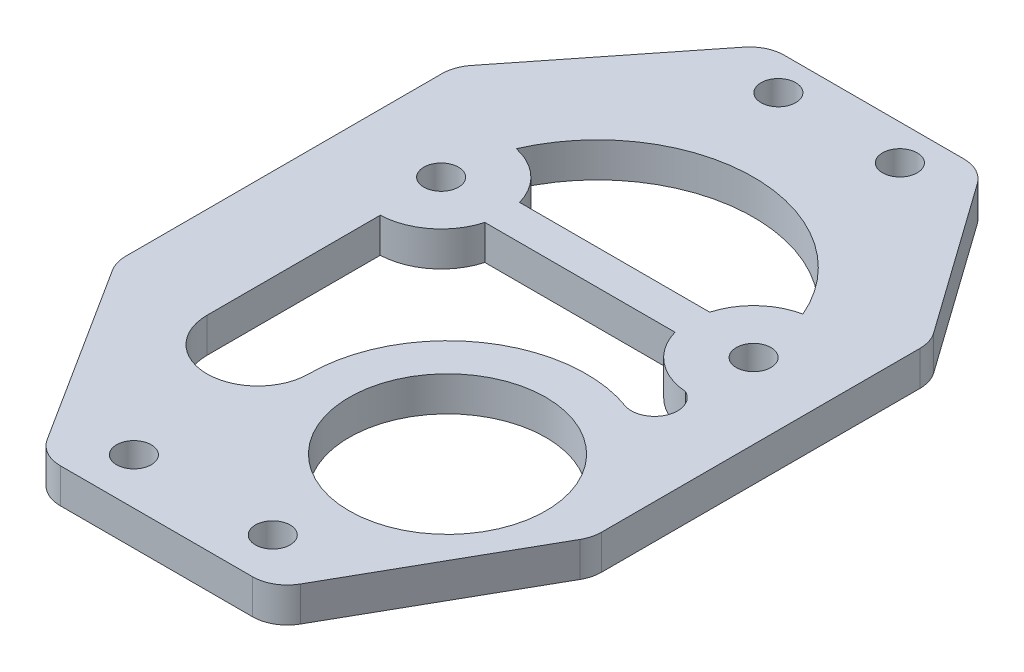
ISO-10303-21;
HEADER;
FILE_DESCRIPTION(('STEP AP214'),'2;1');
FILE_NAME('part.step','',(''),(''),'','','');
FILE_SCHEMA(('AUTOMOTIVE_DESIGN { 1 0 10303 214 1 1 1 1 }'));
ENDSEC;
DATA;
#1=APPLICATION_CONTEXT('core data for automotive mechanical design processes');
#2=APPLICATION_PROTOCOL_DEFINITION('international standard','automotive_design',2000,#1);
#3=PRODUCT_CONTEXT('',#1,'mechanical');
#4=PRODUCT('Part','Part','',(#3));
#5=PRODUCT_RELATED_PRODUCT_CATEGORY('part','',(#4));
#6=PRODUCT_DEFINITION_FORMATION('','',#4);
#7=PRODUCT_DEFINITION_CONTEXT('part definition',#1,'design');
#8=PRODUCT_DEFINITION('design','',#6,#7);
#9=PRODUCT_DEFINITION_SHAPE('','',#8);
#10=(LENGTH_UNIT() NAMED_UNIT(*) SI_UNIT(.MILLI.,.METRE.));
#11=(NAMED_UNIT(*) PLANE_ANGLE_UNIT() SI_UNIT($,.RADIAN.));
#12=(NAMED_UNIT(*) SI_UNIT($,.STERADIAN.) SOLID_ANGLE_UNIT());
#13=UNCERTAINTY_MEASURE_WITH_UNIT(LENGTH_MEASURE(1.E-05),#10,'distance_accuracy_value','');
#14=(GEOMETRIC_REPRESENTATION_CONTEXT(3) GLOBAL_UNCERTAINTY_ASSIGNED_CONTEXT((#13)) GLOBAL_UNIT_ASSIGNED_CONTEXT((#10,
#11,#12)) REPRESENTATION_CONTEXT('',''));
#15=CARTESIAN_POINT('',(0.,0.,0.));
#16=DIRECTION('',(0.,0.,1.));
#17=DIRECTION('',(1.,0.,0.));
#18=AXIS2_PLACEMENT_3D('',#15,#16,#17);
#19=CARTESIAN_POINT('',(-7.79820170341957,3.,-28.));
#20=DIRECTION('',(0.,-1.,0.));
#21=DIRECTION('',(0.,0.,-1.));
#22=AXIS2_PLACEMENT_3D('',#19,#20,#21);
#23=PLANE('',#22);
#24=CARTESIAN_POINT('',(13.5,3.,-7.05));
#25=DIRECTION('',(0.,1.,0.));
#26=DIRECTION('',(0.,0.,1.));
#27=AXIS2_PLACEMENT_3D('',#24,#25,#26);
#28=CIRCLE('',#27,1.5);
#29=CARTESIAN_POINT('',(13.5,3.,-5.55));
#30=VERTEX_POINT('',#29);
#31=EDGE_CURVE('E253',#30,#30,#28,.T.);
#32=ORIENTED_EDGE('',*,*,#31,.F.);
#33=EDGE_LOOP('',(#32));
#34=FACE_BOUND('',#33,.T.);
#35=CARTESIAN_POINT('',(-5.25,3.,-27.9407829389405));
#36=DIRECTION('',(0.,1.,0.));
#37=DIRECTION('',(0.,0.,1.));
#38=AXIS2_PLACEMENT_3D('',#35,#36,#37);
#39=CIRCLE('',#38,1.5);
#40=CARTESIAN_POINT('',(-5.25,3.,-26.4407829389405));
#41=VERTEX_POINT('',#40);
#42=EDGE_CURVE('E259',#41,#41,#39,.T.);
#43=ORIENTED_EDGE('',*,*,#42,.F.);
#44=EDGE_LOOP('',(#43));
#45=FACE_BOUND('',#44,.T.);
#46=CARTESIAN_POINT('',(5.25,3.,-27.9407829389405));
#47=DIRECTION('',(0.,1.,0.));
#48=DIRECTION('',(0.,0.,1.));
#49=AXIS2_PLACEMENT_3D('',#46,#47,#48);
#50=CIRCLE('',#49,1.5);
#51=CARTESIAN_POINT('',(5.25,3.,-26.4407829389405));
#52=VERTEX_POINT('',#51);
#53=EDGE_CURVE('E265',#52,#52,#50,.T.);
#54=ORIENTED_EDGE('',*,*,#53,.F.);
#55=EDGE_LOOP('',(#54));
#56=FACE_BOUND('',#55,.T.);
#57=CARTESIAN_POINT('',(7.5,3.,13.4));
#58=DIRECTION('',(0.,-1.,0.));
#59=DIRECTION('',(0.,0.,1.));
#60=AXIS2_PLACEMENT_3D('',#57,#58,#59);
#61=CIRCLE('',#60,12.);
#62=CARTESIAN_POINT('',(-4.49999999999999,3.,13.4));
#63=VERTEX_POINT('',#62);
#64=CARTESIAN_POINT('',(11.655254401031,3.,2.14238653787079));
#65=VERTEX_POINT('',#64);
#66=EDGE_CURVE('E271',#63,#65,#61,.T.);
#67=ORIENTED_EDGE('',*,*,#66,.F.);
#68=CARTESIAN_POINT('',(-8.89070194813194,3.,13.4));
#69=DIRECTION('',(0.,1.,0.));
#70=DIRECTION('',(0.,0.,1.));
#71=AXIS2_PLACEMENT_3D('',#68,#69,#70);
#72=CIRCLE('',#71,4.39070194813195);
#73=CARTESIAN_POINT('',(-13.2814038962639,3.,13.4));
#74=VERTEX_POINT('',#73);
#75=EDGE_CURVE('E285',#74,#63,#72,.T.);
#76=ORIENTED_EDGE('',*,*,#75,.F.);
#77=DIRECTION('',(0.,0.,1.));
#78=VECTOR('',#77,1.);
#79=CARTESIAN_POINT('',(-13.2814038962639,3.,0.));
#80=LINE('',#79,#78);
#81=CARTESIAN_POINT('',(-13.2814038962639,3.,-1.5679809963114));
#82=VERTEX_POINT('',#81);
#83=EDGE_CURVE('E282',#82,#74,#80,.T.);
#84=ORIENTED_EDGE('',*,*,#83,.F.);
#85=CARTESIAN_POINT('',(-13.5,3.,-7.05));
#86=DIRECTION('',(0.,-1.,0.));
#87=DIRECTION('',(0.,0.,1.));
#88=AXIS2_PLACEMENT_3D('',#85,#86,#87);
#89=CIRCLE('',#88,5.48637554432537);
#90=CARTESIAN_POINT('',(-8.22266008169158,3.,-5.55));
#91=VERTEX_POINT('',#90);
#92=EDGE_CURVE('E280',#91,#82,#89,.T.);
#93=ORIENTED_EDGE('',*,*,#92,.F.);
#94=DIRECTION('',(-1.,0.,0.));
#95=VECTOR('',#94,1.);
#96=CARTESIAN_POINT('',(-8.22266008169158,3.,-5.55));
#97=LINE('',#96,#95);
#98=CARTESIAN_POINT('',(8.20849737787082,3.,-5.55));
#99=VERTEX_POINT('',#98);
#100=EDGE_CURVE('E278',#99,#91,#97,.T.);
#101=ORIENTED_EDGE('',*,*,#100,.F.);
#102=CARTESIAN_POINT('',(13.5,3.,-7.05));
#103=DIRECTION('',(0.,-1.,0.));
#104=DIRECTION('',(0.,0.,1.));
#105=AXIS2_PLACEMENT_3D('',#102,#103,#104);
#106=CIRCLE('',#105,5.5);
#107=CARTESIAN_POINT('',(13.113110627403,3.,-1.56362445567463));
#108=VERTEX_POINT('',#107);
#109=EDGE_CURVE('E276',#108,#99,#106,.T.);
#110=ORIENTED_EDGE('',*,*,#109,.F.);
#111=CARTESIAN_POINT('',(12.21,3.,0.220861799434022));
#112=DIRECTION('',(0.,1.,0.));
#113=DIRECTION('',(0.,0.,1.));
#114=AXIS2_PLACEMENT_3D('',#111,#112,#113);
#115=CIRCLE('',#114,2.);
#116=EDGE_CURVE('E273',#65,#108,#115,.T.);
#117=ORIENTED_EDGE('',*,*,#116,.F.);
#118=EDGE_LOOP('',(#67,#76,#84,#93,#101,#110,#117));
#119=FACE_BOUND('',#118,.T.);
#120=CARTESIAN_POINT('',(-7.79820170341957,3.,-28.));
#121=DIRECTION('',(0.,1.,0.));
#122=DIRECTION('',(0.,0.,-1.));
#123=AXIS2_PLACEMENT_3D('',#120,#121,#122);
#124=CIRCLE('',#123,3.);
#125=CARTESIAN_POINT('',(-7.79820170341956,3.,-31.));
#126=VERTEX_POINT('',#125);
#127=CARTESIAN_POINT('',(-10.1508333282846,3.,-29.8614844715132));
#128=VERTEX_POINT('',#127);
#129=EDGE_CURVE('E348',#126,#128,#124,.T.);
#130=ORIENTED_EDGE('',*,*,#129,.T.);
#131=DIRECTION('',(-0.620494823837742,0.,0.784210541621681));
#132=VECTOR('',#131,1.);
#133=CARTESIAN_POINT('',(-20.5640355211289,3.,-16.7007897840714));
#134=LINE('',#133,#132);
#135=CARTESIAN_POINT('',(-20.5640355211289,3.,-16.7007897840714));
#136=VERTEX_POINT('',#135);
#137=EDGE_CURVE('E351',#128,#136,#134,.T.);
#138=ORIENTED_EDGE('',*,*,#137,.T.);
#139=CARTESIAN_POINT('',(-18.2114038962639,3.,-14.8393053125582));
#140=DIRECTION('',(0.,1.,0.));
#141=DIRECTION('',(0.,0.,-1.));
#142=AXIS2_PLACEMENT_3D('',#139,#140,#141);
#143=CIRCLE('',#142,3.);
#144=CARTESIAN_POINT('',(-21.2114038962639,3.,-14.8393053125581));
#145=VERTEX_POINT('',#144);
#146=EDGE_CURVE('E354',#136,#145,#143,.T.);
#147=ORIENTED_EDGE('',*,*,#146,.T.);
#148=DIRECTION('',(0.,0.,1.));
#149=VECTOR('',#148,1.);
#150=CARTESIAN_POINT('',(-21.2114038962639,3.,-14.8393053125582));
#151=LINE('',#150,#149);
#152=CARTESIAN_POINT('',(-21.2114038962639,3.,12.4977287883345));
#153=VERTEX_POINT('',#152);
#154=EDGE_CURVE('E356',#145,#153,#151,.T.);
#155=ORIENTED_EDGE('',*,*,#154,.T.);
#156=CARTESIAN_POINT('',(-18.2114038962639,3.,12.4977287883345));
#157=DIRECTION('',(0.,1.,0.));
#158=DIRECTION('',(0.,0.,1.));
#159=AXIS2_PLACEMENT_3D('',#156,#157,#158);
#160=CIRCLE('',#159,3.);
#161=CARTESIAN_POINT('',(-20.7428525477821,3.,14.1076255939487));
#162=VERTEX_POINT('',#161);
#163=EDGE_CURVE('E358',#153,#162,#160,.T.);
#164=ORIENTED_EDGE('',*,*,#163,.T.);
#165=DIRECTION('',(0.536632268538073,0.,0.843816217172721));
#166=VECTOR('',#165,1.);
#167=CARTESIAN_POINT('',(-20.7428525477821,3.,14.1076255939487));
#168=LINE('',#167,#166);
#169=CARTESIAN_POINT('',(-10.8840482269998,3.,29.6098968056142));
#170=VERTEX_POINT('',#169);
#171=EDGE_CURVE('E360',#162,#170,#168,.T.);
#172=ORIENTED_EDGE('',*,*,#171,.T.);
#173=CARTESIAN_POINT('',(-8.35259957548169,3.,28.));
#174=DIRECTION('',(0.,1.,0.));
#175=DIRECTION('',(0.,0.,1.));
#176=AXIS2_PLACEMENT_3D('',#173,#174,#175);
#177=CIRCLE('',#176,2.99999999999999);
#178=CARTESIAN_POINT('',(-8.35259957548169,3.,31.));
#179=VERTEX_POINT('',#178);
#180=EDGE_CURVE('E362',#170,#179,#177,.T.);
#181=ORIENTED_EDGE('',*,*,#180,.T.);
#182=DIRECTION('',(1.,0.,0.));
#183=VECTOR('',#182,1.);
#184=CARTESIAN_POINT('',(-8.35259957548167,3.,31.));
#185=LINE('',#184,#183);
#186=CARTESIAN_POINT('',(8.25268787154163,3.,31.));
#187=VERTEX_POINT('',#186);
#188=EDGE_CURVE('E364',#179,#187,#185,.T.);
#189=ORIENTED_EDGE('',*,*,#188,.T.);
#190=CARTESIAN_POINT('',(8.25268787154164,3.,28.));
#191=DIRECTION('',(0.,1.,0.));
#192=DIRECTION('',(0.,0.,-1.));
#193=AXIS2_PLACEMENT_3D('',#190,#191,#192);
#194=CIRCLE('',#193,3.);
#195=CARTESIAN_POINT('',(10.8621094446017,3.,29.4801753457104));
#196=VERTEX_POINT('',#195);
#197=EDGE_CURVE('E366',#187,#196,#194,.T.);
#198=ORIENTED_EDGE('',*,*,#197,.T.);
#199=DIRECTION('',(0.493391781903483,0.,-0.869807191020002));
#200=VECTOR('',#199,1.);
#201=CARTESIAN_POINT('',(19.60942157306,3.,14.0594179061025));
#202=LINE('',#201,#200);
#203=CARTESIAN_POINT('',(19.60942157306,3.,14.0594179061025));
#204=VERTEX_POINT('',#203);
#205=EDGE_CURVE('E368',#196,#204,#202,.T.);
#206=ORIENTED_EDGE('',*,*,#205,.T.);
#207=CARTESIAN_POINT('',(17.,3.,12.5792425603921));
#208=DIRECTION('',(0.,1.,0.));
#209=DIRECTION('',(0.,0.,1.));
#210=AXIS2_PLACEMENT_3D('',#207,#208,#209);
#211=CIRCLE('',#210,3.);
#212=CARTESIAN_POINT('',(20.,3.,12.579242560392));
#213=VERTEX_POINT('',#212);
#214=EDGE_CURVE('E370',#204,#213,#211,.T.);
#215=ORIENTED_EDGE('',*,*,#214,.T.);
#216=DIRECTION('',(0.,0.,-1.));
#217=VECTOR('',#216,1.);
#218=CARTESIAN_POINT('',(20.,3.,-14.924711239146));
#219=LINE('',#218,#217);
#220=CARTESIAN_POINT('',(20.,3.,-14.924711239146));
#221=VERTEX_POINT('',#220);
#222=EDGE_CURVE('E372',#213,#221,#219,.T.);
#223=ORIENTED_EDGE('',*,*,#222,.T.);
#224=CARTESIAN_POINT('',(17.,3.,-14.9247112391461));
#225=DIRECTION('',(0.,1.,0.));
#226=DIRECTION('',(0.,0.,-1.));
#227=AXIS2_PLACEMENT_3D('',#224,#225,#226);
#228=CIRCLE('',#227,3.);
#229=CARTESIAN_POINT('',(19.4448766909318,3.,-16.6632675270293));
#230=VERTEX_POINT('',#229);
#231=EDGE_CURVE('E374',#221,#230,#228,.T.);
#232=ORIENTED_EDGE('',*,*,#231,.T.);
#233=DIRECTION('',(-0.579518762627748,0.,-0.814958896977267));
#234=VECTOR('',#233,1.);
#235=CARTESIAN_POINT('',(10.1470149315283,3.,-29.7385562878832));
#236=LINE('',#235,#234);
#237=CARTESIAN_POINT('',(10.1470149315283,3.,-29.7385562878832));
#238=VERTEX_POINT('',#237);
#239=EDGE_CURVE('E376',#230,#238,#236,.T.);
#240=ORIENTED_EDGE('',*,*,#239,.T.);
#241=CARTESIAN_POINT('',(7.70213824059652,3.,-28.));
#242=DIRECTION('',(0.,1.,0.));
#243=DIRECTION('',(0.,0.,1.));
#244=AXIS2_PLACEMENT_3D('',#241,#242,#243);
#245=CIRCLE('',#244,3.);
#246=CARTESIAN_POINT('',(7.70213824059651,3.,-31.));
#247=VERTEX_POINT('',#246);
#248=EDGE_CURVE('E378',#238,#247,#245,.T.);
#249=ORIENTED_EDGE('',*,*,#248,.T.);
#250=DIRECTION('',(-1.,0.,0.));
#251=VECTOR('',#250,1.);
#252=CARTESIAN_POINT('',(-7.79820170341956,3.,-31.));
#253=LINE('',#252,#251);
#254=EDGE_CURVE('E380',#247,#126,#253,.T.);
#255=ORIENTED_EDGE('',*,*,#254,.T.);
#256=EDGE_LOOP('',(#130,#138,#147,#155,#164,#172,#181,#189,#198,#206,#215,#223,#232,#240,#249,#255));
#257=FACE_BOUND('',#256,.T.);
#258=CARTESIAN_POINT('',(-13.5,3.,-7.05));
#259=DIRECTION('',(0.,1.,0.));
#260=DIRECTION('',(0.,0.,1.));
#261=AXIS2_PLACEMENT_3D('',#258,#259,#260);
#262=CIRCLE('',#261,1.5);
#263=CARTESIAN_POINT('',(-13.5,3.,-5.55));
#264=VERTEX_POINT('',#263);
#265=EDGE_CURVE('E342',#264,#264,#262,.T.);
#266=ORIENTED_EDGE('',*,*,#265,.F.);
#267=EDGE_LOOP('',(#266));
#268=FACE_BOUND('',#267,.T.);
#269=CARTESIAN_POINT('',(7.5,3.,13.4));
#270=DIRECTION('',(0.,1.,0.));
#271=DIRECTION('',(0.,0.,1.));
#272=AXIS2_PLACEMENT_3D('',#269,#270,#271);
#273=CIRCLE('',#272,8.5);
#274=CARTESIAN_POINT('',(7.5,3.,21.9));
#275=VERTEX_POINT('',#274);
#276=EDGE_CURVE('E336',#275,#275,#273,.T.);
#277=ORIENTED_EDGE('',*,*,#276,.F.);
#278=EDGE_LOOP('',(#277));
#279=FACE_BOUND('',#278,.T.);
#280=CARTESIAN_POINT('',(6.00000000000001,3.,27.));
#281=DIRECTION('',(0.,1.,0.));
#282=DIRECTION('',(0.,0.,1.));
#283=AXIS2_PLACEMENT_3D('',#280,#281,#282);
#284=CIRCLE('',#283,1.5);
#285=CARTESIAN_POINT('',(6.00000000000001,3.,28.5));
#286=VERTEX_POINT('',#285);
#287=EDGE_CURVE('E330',#286,#286,#284,.T.);
#288=ORIENTED_EDGE('',*,*,#287,.F.);
#289=EDGE_LOOP('',(#288));
#290=FACE_BOUND('',#289,.T.);
#291=CARTESIAN_POINT('',(-5.99999999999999,3.,27.));
#292=DIRECTION('',(0.,1.,0.));
#293=DIRECTION('',(0.,0.,1.));
#294=AXIS2_PLACEMENT_3D('',#291,#292,#293);
#295=CIRCLE('',#294,1.5);
#296=CARTESIAN_POINT('',(-5.99999999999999,3.,28.5));
#297=VERTEX_POINT('',#296);
#298=EDGE_CURVE('E324',#297,#297,#295,.T.);
#299=ORIENTED_EDGE('',*,*,#298,.F.);
#300=EDGE_LOOP('',(#299));
#301=FACE_BOUND('',#300,.T.);
#302=CARTESIAN_POINT('',(0.,3.,-7.05));
#303=DIRECTION('',(0.,1.,0.));
#304=DIRECTION('',(0.,0.,1.));
#305=AXIS2_PLACEMENT_3D('',#302,#303,#304);
#306=CIRCLE('',#305,13.5);
#307=CARTESIAN_POINT('',(12.3796296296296,3.,-12.4346792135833));
#308=VERTEX_POINT('',#307);
#309=CARTESIAN_POINT('',(-12.385173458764,3.,-12.4219157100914));
#310=VERTEX_POINT('',#309);
#311=EDGE_CURVE('E217',#308,#310,#306,.T.);
#312=ORIENTED_EDGE('',*,*,#311,.F.);
#313=CARTESIAN_POINT('',(13.5,3.,-7.05));
#314=DIRECTION('',(0.,-1.,0.));
#315=DIRECTION('',(0.,0.,1.));
#316=AXIS2_PLACEMENT_3D('',#313,#314,#315);
#317=CIRCLE('',#316,5.5);
#318=CARTESIAN_POINT('',(8.20849737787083,3.,-8.55));
#319=VERTEX_POINT('',#318);
#320=EDGE_CURVE('E239',#319,#308,#317,.T.);
#321=ORIENTED_EDGE('',*,*,#320,.F.);
#322=DIRECTION('',(1.,0.,0.));
#323=VECTOR('',#322,1.);
#324=CARTESIAN_POINT('',(-8.22266008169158,3.,-8.55));
#325=LINE('',#324,#323);
#326=CARTESIAN_POINT('',(-8.22266008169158,3.,-8.55));
#327=VERTEX_POINT('',#326);
#328=EDGE_CURVE('E237',#327,#319,#325,.T.);
#329=ORIENTED_EDGE('',*,*,#328,.F.);
#330=CARTESIAN_POINT('',(-13.5,3.,-7.05));
#331=DIRECTION('',(0.,-1.,0.));
#332=DIRECTION('',(0.,0.,1.));
#333=AXIS2_PLACEMENT_3D('',#330,#331,#332);
#334=CIRCLE('',#333,5.48637554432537);
#335=EDGE_CURVE('E225',#310,#327,#334,.T.);
#336=ORIENTED_EDGE('',*,*,#335,.F.);
#337=EDGE_LOOP('',(#312,#321,#329,#336));
#338=FACE_BOUND('',#337,.T.);
#339=ADVANCED_FACE('F38',(#34,#45,#56,#119,#257,#268,#279,#290,#301,#338),#23,.F.);
#340=CARTESIAN_POINT('',(-7.79820170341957,0.,-28.));
#341=DIRECTION('',(0.,-1.,0.));
#342=DIRECTION('',(0.,0.,-1.));
#343=AXIS2_PLACEMENT_3D('',#340,#341,#342);
#344=PLANE('',#343);
#345=CARTESIAN_POINT('',(-5.25,0.,-27.9407829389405));
#346=DIRECTION('',(0.,1.,0.));
#347=DIRECTION('',(0.,0.,1.));
#348=AXIS2_PLACEMENT_3D('',#345,#346,#347);
#349=CIRCLE('',#348,1.5);
#350=CARTESIAN_POINT('',(-5.25,0.,-26.4407829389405));
#351=VERTEX_POINT('',#350);
#352=EDGE_CURVE('E256',#351,#351,#349,.T.);
#353=ORIENTED_EDGE('',*,*,#352,.T.);
#354=EDGE_LOOP('',(#353));
#355=FACE_BOUND('',#354,.T.);
#356=CARTESIAN_POINT('',(-8.89070194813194,0.,13.4));
#357=DIRECTION('',(0.,1.,0.));
#358=DIRECTION('',(0.,0.,1.));
#359=AXIS2_PLACEMENT_3D('',#356,#357,#358);
#360=CIRCLE('',#359,4.39070194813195);
#361=CARTESIAN_POINT('',(-13.2814038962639,0.,13.4));
#362=VERTEX_POINT('',#361);
#363=CARTESIAN_POINT('',(-4.49999999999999,0.,13.4));
#364=VERTEX_POINT('',#363);
#365=EDGE_CURVE('E274',#362,#364,#360,.T.);
#366=ORIENTED_EDGE('',*,*,#365,.T.);
#367=CARTESIAN_POINT('',(7.5,0.,13.4));
#368=DIRECTION('',(0.,-1.,0.));
#369=DIRECTION('',(0.,0.,1.));
#370=AXIS2_PLACEMENT_3D('',#367,#368,#369);
#371=CIRCLE('',#370,12.);
#372=CARTESIAN_POINT('',(11.655254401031,0.,2.14238653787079));
#373=VERTEX_POINT('',#372);
#374=EDGE_CURVE('E268',#364,#373,#371,.T.);
#375=ORIENTED_EDGE('',*,*,#374,.T.);
#376=CARTESIAN_POINT('',(12.21,0.,0.220861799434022));
#377=DIRECTION('',(0.,1.,0.));
#378=DIRECTION('',(0.,0.,1.));
#379=AXIS2_PLACEMENT_3D('',#376,#377,#378);
#380=CIRCLE('',#379,2.);
#381=CARTESIAN_POINT('',(13.113110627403,0.,-1.56362445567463));
#382=VERTEX_POINT('',#381);
#383=EDGE_CURVE('E290',#373,#382,#380,.T.);
#384=ORIENTED_EDGE('',*,*,#383,.T.);
#385=CARTESIAN_POINT('',(13.5,0.,-7.05));
#386=DIRECTION('',(0.,-1.,0.));
#387=DIRECTION('',(0.,0.,1.));
#388=AXIS2_PLACEMENT_3D('',#385,#386,#387);
#389=CIRCLE('',#388,5.5);
#390=CARTESIAN_POINT('',(8.20849737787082,0.,-5.55));
#391=VERTEX_POINT('',#390);
#392=EDGE_CURVE('E293',#382,#391,#389,.T.);
#393=ORIENTED_EDGE('',*,*,#392,.T.);
#394=DIRECTION('',(-1.,0.,0.));
#395=VECTOR('',#394,1.);
#396=CARTESIAN_POINT('',(-8.22266008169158,0.,-5.55));
#397=LINE('',#396,#395);
#398=CARTESIAN_POINT('',(-8.22266008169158,0.,-5.55));
#399=VERTEX_POINT('',#398);
#400=EDGE_CURVE('E296',#391,#399,#397,.T.);
#401=ORIENTED_EDGE('',*,*,#400,.T.);
#402=CARTESIAN_POINT('',(-13.5,0.,-7.05));
#403=DIRECTION('',(0.,-1.,0.));
#404=DIRECTION('',(0.,0.,1.));
#405=AXIS2_PLACEMENT_3D('',#402,#403,#404);
#406=CIRCLE('',#405,5.48637554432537);
#407=CARTESIAN_POINT('',(-13.2814038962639,0.,-1.5679809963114));
#408=VERTEX_POINT('',#407);
#409=EDGE_CURVE('E299',#399,#408,#406,.T.);
#410=ORIENTED_EDGE('',*,*,#409,.T.);
#411=DIRECTION('',(0.,0.,1.));
#412=VECTOR('',#411,1.);
#413=CARTESIAN_POINT('',(-13.2814038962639,0.,13.4));
#414=LINE('',#413,#412);
#415=EDGE_CURVE('E302',#408,#362,#414,.T.);
#416=ORIENTED_EDGE('',*,*,#415,.T.);
#417=EDGE_LOOP('',(#366,#375,#384,#393,#401,#410,#416));
#418=FACE_BOUND('',#417,.T.);
#419=CARTESIAN_POINT('',(-5.99999999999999,0.,27.));
#420=DIRECTION('',(0.,1.,0.));
#421=DIRECTION('',(0.,0.,1.));
#422=AXIS2_PLACEMENT_3D('',#419,#420,#421);
#423=CIRCLE('',#422,1.5);
#424=CARTESIAN_POINT('',(-5.99999999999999,0.,28.5));
#425=VERTEX_POINT('',#424);
#426=EDGE_CURVE('E323',#425,#425,#423,.T.);
#427=ORIENTED_EDGE('',*,*,#426,.T.);
#428=EDGE_LOOP('',(#427));
#429=FACE_BOUND('',#428,.T.);
#430=CARTESIAN_POINT('',(7.5,0.,13.4));
#431=DIRECTION('',(0.,1.,0.));
#432=DIRECTION('',(0.,0.,1.));
#433=AXIS2_PLACEMENT_3D('',#430,#431,#432);
#434=CIRCLE('',#433,8.5);
#435=CARTESIAN_POINT('',(7.5,0.,21.9));
#436=VERTEX_POINT('',#435);
#437=EDGE_CURVE('E333',#436,#436,#434,.T.);
#438=ORIENTED_EDGE('',*,*,#437,.T.);
#439=EDGE_LOOP('',(#438));
#440=FACE_BOUND('',#439,.T.);
#441=CARTESIAN_POINT('',(-7.79820170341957,0.,-28.));
#442=DIRECTION('',(0.,1.,0.));
#443=DIRECTION('',(0.,0.,-1.));
#444=AXIS2_PLACEMENT_3D('',#441,#442,#443);
#445=CIRCLE('',#444,3.);
#446=CARTESIAN_POINT('',(-7.79820170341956,0.,-31.));
#447=VERTEX_POINT('',#446);
#448=CARTESIAN_POINT('',(-10.1508333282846,0.,-29.8614844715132));
#449=VERTEX_POINT('',#448);
#450=EDGE_CURVE('E345',#447,#449,#445,.T.);
#451=ORIENTED_EDGE('',*,*,#450,.F.);
#452=DIRECTION('',(-1.,0.,0.));
#453=VECTOR('',#452,1.);
#454=CARTESIAN_POINT('',(-7.79820170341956,0.,-31.));
#455=LINE('',#454,#453);
#456=CARTESIAN_POINT('',(7.70213824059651,0.,-31.));
#457=VERTEX_POINT('',#456);
#458=EDGE_CURVE('E352',#457,#447,#455,.T.);
#459=ORIENTED_EDGE('',*,*,#458,.F.);
#460=CARTESIAN_POINT('',(7.70213824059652,0.,-28.));
#461=DIRECTION('',(0.,1.,0.));
#462=DIRECTION('',(0.,0.,1.));
#463=AXIS2_PLACEMENT_3D('',#460,#461,#462);
#464=CIRCLE('',#463,3.);
#465=CARTESIAN_POINT('',(10.1470149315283,0.,-29.7385562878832));
#466=VERTEX_POINT('',#465);
#467=EDGE_CURVE('E411',#466,#457,#464,.T.);
#468=ORIENTED_EDGE('',*,*,#467,.F.);
#469=DIRECTION('',(-0.579518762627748,0.,-0.814958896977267));
#470=VECTOR('',#469,1.);
#471=CARTESIAN_POINT('',(10.1470149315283,0.,-29.7385562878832));
#472=LINE('',#471,#470);
#473=CARTESIAN_POINT('',(19.4448766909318,0.,-16.6632675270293));
#474=VERTEX_POINT('',#473);
#475=EDGE_CURVE('E409',#474,#466,#472,.T.);
#476=ORIENTED_EDGE('',*,*,#475,.F.);
#477=CARTESIAN_POINT('',(17.,0.,-14.9247112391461));
#478=DIRECTION('',(0.,1.,0.));
#479=DIRECTION('',(0.,0.,-1.));
#480=AXIS2_PLACEMENT_3D('',#477,#478,#479);
#481=CIRCLE('',#480,3.);
#482=CARTESIAN_POINT('',(20.,0.,-14.924711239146));
#483=VERTEX_POINT('',#482);
#484=EDGE_CURVE('E407',#483,#474,#481,.T.);
#485=ORIENTED_EDGE('',*,*,#484,.F.);
#486=DIRECTION('',(0.,0.,-1.));
#487=VECTOR('',#486,1.);
#488=CARTESIAN_POINT('',(20.,0.,-14.924711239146));
#489=LINE('',#488,#487);
#490=CARTESIAN_POINT('',(20.,0.,12.579242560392));
#491=VERTEX_POINT('',#490);
#492=EDGE_CURVE('E405',#491,#483,#489,.T.);
#493=ORIENTED_EDGE('',*,*,#492,.F.);
#494=CARTESIAN_POINT('',(17.,0.,12.5792425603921));
#495=DIRECTION('',(0.,1.,0.));
#496=DIRECTION('',(0.,0.,1.));
#497=AXIS2_PLACEMENT_3D('',#494,#495,#496);
#498=CIRCLE('',#497,3.);
#499=CARTESIAN_POINT('',(19.60942157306,0.,14.0594179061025));
#500=VERTEX_POINT('',#499);
#501=EDGE_CURVE('E403',#500,#491,#498,.T.);
#502=ORIENTED_EDGE('',*,*,#501,.F.);
#503=DIRECTION('',(0.493391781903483,0.,-0.869807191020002));
#504=VECTOR('',#503,1.);
#505=CARTESIAN_POINT('',(19.60942157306,0.,14.0594179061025));
#506=LINE('',#505,#504);
#507=CARTESIAN_POINT('',(10.8621094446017,0.,29.4801753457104));
#508=VERTEX_POINT('',#507);
#509=EDGE_CURVE('E401',#508,#500,#506,.T.);
#510=ORIENTED_EDGE('',*,*,#509,.F.);
#511=CARTESIAN_POINT('',(8.25268787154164,0.,28.));
#512=DIRECTION('',(0.,1.,0.));
#513=DIRECTION('',(0.,0.,-1.));
#514=AXIS2_PLACEMENT_3D('',#511,#512,#513);
#515=CIRCLE('',#514,3.);
#516=CARTESIAN_POINT('',(8.25268787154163,0.,31.));
#517=VERTEX_POINT('',#516);
#518=EDGE_CURVE('E399',#517,#508,#515,.T.);
#519=ORIENTED_EDGE('',*,*,#518,.F.);
#520=DIRECTION('',(1.,0.,0.));
#521=VECTOR('',#520,1.);
#522=CARTESIAN_POINT('',(-8.35259957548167,0.,31.));
#523=LINE('',#522,#521);
#524=CARTESIAN_POINT('',(-8.35259957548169,0.,31.));
#525=VERTEX_POINT('',#524);
#526=EDGE_CURVE('E397',#525,#517,#523,.T.);
#527=ORIENTED_EDGE('',*,*,#526,.F.);
#528=CARTESIAN_POINT('',(-8.35259957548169,0.,28.));
#529=DIRECTION('',(0.,1.,0.));
#530=DIRECTION('',(0.,0.,1.));
#531=AXIS2_PLACEMENT_3D('',#528,#529,#530);
#532=CIRCLE('',#531,2.99999999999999);
#533=CARTESIAN_POINT('',(-10.8840482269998,0.,29.6098968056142));
#534=VERTEX_POINT('',#533);
#535=EDGE_CURVE('E395',#534,#525,#532,.T.);
#536=ORIENTED_EDGE('',*,*,#535,.F.);
#537=DIRECTION('',(0.536632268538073,0.,0.843816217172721));
#538=VECTOR('',#537,1.);
#539=CARTESIAN_POINT('',(-20.7428525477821,0.,14.1076255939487));
#540=LINE('',#539,#538);
#541=CARTESIAN_POINT('',(-20.7428525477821,0.,14.1076255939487));
#542=VERTEX_POINT('',#541);
#543=EDGE_CURVE('E393',#542,#534,#540,.T.);
#544=ORIENTED_EDGE('',*,*,#543,.F.);
#545=CARTESIAN_POINT('',(-18.2114038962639,0.,12.4977287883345));
#546=DIRECTION('',(0.,1.,0.));
#547=DIRECTION('',(0.,0.,1.));
#548=AXIS2_PLACEMENT_3D('',#545,#546,#547);
#549=CIRCLE('',#548,3.);
#550=CARTESIAN_POINT('',(-21.2114038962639,0.,12.4977287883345));
#551=VERTEX_POINT('',#550);
#552=EDGE_CURVE('E391',#551,#542,#549,.T.);
#553=ORIENTED_EDGE('',*,*,#552,.F.);
#554=DIRECTION('',(0.,0.,1.));
#555=VECTOR('',#554,1.);
#556=CARTESIAN_POINT('',(-21.2114038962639,0.,-14.8393053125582));
#557=LINE('',#556,#555);
#558=CARTESIAN_POINT('',(-21.2114038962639,0.,-14.8393053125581));
#559=VERTEX_POINT('',#558);
#560=EDGE_CURVE('E389',#559,#551,#557,.T.);
#561=ORIENTED_EDGE('',*,*,#560,.F.);
#562=CARTESIAN_POINT('',(-18.2114038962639,0.,-14.8393053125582));
#563=DIRECTION('',(0.,1.,0.));
#564=DIRECTION('',(0.,0.,-1.));
#565=AXIS2_PLACEMENT_3D('',#562,#563,#564);
#566=CIRCLE('',#565,3.);
#567=CARTESIAN_POINT('',(-20.5640355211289,0.,-16.7007897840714));
#568=VERTEX_POINT('',#567);
#569=EDGE_CURVE('E387',#568,#559,#566,.T.);
#570=ORIENTED_EDGE('',*,*,#569,.F.);
#571=DIRECTION('',(-0.620494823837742,0.,0.784210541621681));
#572=VECTOR('',#571,1.);
#573=CARTESIAN_POINT('',(-20.5640355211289,0.,-16.7007897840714));
#574=LINE('',#573,#572);
#575=EDGE_CURVE('E385',#449,#568,#574,.T.);
#576=ORIENTED_EDGE('',*,*,#575,.F.);
#577=EDGE_LOOP('',(#451,#459,#468,#476,#485,#493,#502,#510,#519,#527,#536,#544,#553,#561,#570,#576));
#578=FACE_BOUND('',#577,.T.);
#579=CARTESIAN_POINT('',(-13.5,0.,-7.05));
#580=DIRECTION('',(0.,1.,0.));
#581=DIRECTION('',(0.,0.,1.));
#582=AXIS2_PLACEMENT_3D('',#579,#580,#581);
#583=CIRCLE('',#582,1.5);
#584=CARTESIAN_POINT('',(-13.5,0.,-5.55));
#585=VERTEX_POINT('',#584);
#586=EDGE_CURVE('E339',#585,#585,#583,.T.);
#587=ORIENTED_EDGE('',*,*,#586,.T.);
#588=EDGE_LOOP('',(#587));
#589=FACE_BOUND('',#588,.T.);
#590=CARTESIAN_POINT('',(6.00000000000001,0.,27.));
#591=DIRECTION('',(0.,1.,0.));
#592=DIRECTION('',(0.,0.,1.));
#593=AXIS2_PLACEMENT_3D('',#590,#591,#592);
#594=CIRCLE('',#593,1.5);
#595=CARTESIAN_POINT('',(6.00000000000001,0.,28.5));
#596=VERTEX_POINT('',#595);
#597=EDGE_CURVE('E327',#596,#596,#594,.T.);
#598=ORIENTED_EDGE('',*,*,#597,.T.);
#599=EDGE_LOOP('',(#598));
#600=FACE_BOUND('',#599,.T.);
#601=CARTESIAN_POINT('',(5.25,0.,-27.9407829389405));
#602=DIRECTION('',(0.,1.,0.));
#603=DIRECTION('',(0.,0.,1.));
#604=AXIS2_PLACEMENT_3D('',#601,#602,#603);
#605=CIRCLE('',#604,1.5);
#606=CARTESIAN_POINT('',(5.25,0.,-26.4407829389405));
#607=VERTEX_POINT('',#606);
#608=EDGE_CURVE('E262',#607,#607,#605,.T.);
#609=ORIENTED_EDGE('',*,*,#608,.T.);
#610=EDGE_LOOP('',(#609));
#611=FACE_BOUND('',#610,.T.);
#612=CARTESIAN_POINT('',(13.5,0.,-7.05));
#613=DIRECTION('',(0.,1.,0.));
#614=DIRECTION('',(0.,0.,1.));
#615=AXIS2_PLACEMENT_3D('',#612,#613,#614);
#616=CIRCLE('',#615,1.5);
#617=CARTESIAN_POINT('',(13.5,0.,-5.55));
#618=VERTEX_POINT('',#617);
#619=EDGE_CURVE('E233',#618,#618,#616,.T.);
#620=ORIENTED_EDGE('',*,*,#619,.T.);
#621=EDGE_LOOP('',(#620));
#622=FACE_BOUND('',#621,.T.);
#623=CARTESIAN_POINT('',(13.5,0.,-7.05));
#624=DIRECTION('',(0.,-1.,0.));
#625=DIRECTION('',(0.,0.,1.));
#626=AXIS2_PLACEMENT_3D('',#623,#624,#625);
#627=CIRCLE('',#626,5.5);
#628=CARTESIAN_POINT('',(8.20849737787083,0.,-8.55));
#629=VERTEX_POINT('',#628);
#630=CARTESIAN_POINT('',(12.3796296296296,0.,-12.4346792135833));
#631=VERTEX_POINT('',#630);
#632=EDGE_CURVE('E226',#629,#631,#627,.T.);
#633=ORIENTED_EDGE('',*,*,#632,.T.);
#634=CARTESIAN_POINT('',(0.,0.,-7.05));
#635=DIRECTION('',(0.,1.,0.));
#636=DIRECTION('',(0.,0.,1.));
#637=AXIS2_PLACEMENT_3D('',#634,#635,#636);
#638=CIRCLE('',#637,13.5);
#639=CARTESIAN_POINT('',(-12.385173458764,0.,-12.4219157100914));
#640=VERTEX_POINT('',#639);
#641=EDGE_CURVE('E61',#631,#640,#638,.T.);
#642=ORIENTED_EDGE('',*,*,#641,.T.);
#643=CARTESIAN_POINT('',(-13.5,0.,-7.05));
#644=DIRECTION('',(0.,-1.,0.));
#645=DIRECTION('',(0.,0.,1.));
#646=AXIS2_PLACEMENT_3D('',#643,#644,#645);
#647=CIRCLE('',#646,5.48637554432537);
#648=CARTESIAN_POINT('',(-8.22266008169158,0.,-8.55));
#649=VERTEX_POINT('',#648);
#650=EDGE_CURVE('E232',#640,#649,#647,.T.);
#651=ORIENTED_EDGE('',*,*,#650,.T.);
#652=DIRECTION('',(1.,0.,0.));
#653=VECTOR('',#652,1.);
#654=CARTESIAN_POINT('',(-8.22266008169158,0.,-8.55));
#655=LINE('',#654,#653);
#656=EDGE_CURVE('E245',#649,#629,#655,.T.);
#657=ORIENTED_EDGE('',*,*,#656,.T.);
#658=EDGE_LOOP('',(#633,#642,#651,#657));
#659=FACE_BOUND('',#658,.T.);
#660=ADVANCED_FACE('F465',(#355,#418,#429,#440,#578,#589,#600,#611,#622,#659),#344,.T.);
#661=CARTESIAN_POINT('',(-7.79820170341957,3.,-28.));
#662=DIRECTION('',(0.,-1.,0.));
#663=DIRECTION('',(0.,0.,-1.));
#664=AXIS2_PLACEMENT_3D('',#661,#662,#663);
#665=CYLINDRICAL_SURFACE('',#664,3.);
#666=ORIENTED_EDGE('',*,*,#450,.T.);
#667=DIRECTION('',(0.,-1.,0.));
#668=VECTOR('',#667,1.);
#669=CARTESIAN_POINT('',(-10.1508333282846,3.,-29.8614844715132));
#670=LINE('',#669,#668);
#671=EDGE_CURVE('E11',#128,#449,#670,.T.);
#672=ORIENTED_EDGE('',*,*,#671,.F.);
#673=ORIENTED_EDGE('',*,*,#129,.F.);
#674=DIRECTION('',(0.,-1.,0.));
#675=VECTOR('',#674,1.);
#676=CARTESIAN_POINT('',(-7.79820170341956,3.,-31.));
#677=LINE('',#676,#675);
#678=EDGE_CURVE('E382',#126,#447,#677,.T.);
#679=ORIENTED_EDGE('',*,*,#678,.T.);
#680=EDGE_LOOP('',(#666,#672,#673,#679));
#681=FACE_BOUND('',#680,.T.);
#682=ADVANCED_FACE('F40',(#681),#665,.T.);
#683=CARTESIAN_POINT('',(-20.5640355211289,3.,-16.7007897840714));
#684=DIRECTION('',(0.784210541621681,0.,0.620494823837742));
#685=DIRECTION('',(0.620494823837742,0.,-0.784210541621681));
#686=AXIS2_PLACEMENT_3D('',#683,#684,#685);
#687=PLANE('',#686);
#688=ORIENTED_EDGE('',*,*,#575,.T.);
#689=DIRECTION('',(0.,-1.,0.));
#690=VECTOR('',#689,1.);
#691=CARTESIAN_POINT('',(-20.5640355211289,3.,-16.7007897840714));
#692=LINE('',#691,#690);
#693=EDGE_CURVE('E46',#136,#568,#692,.T.);
#694=ORIENTED_EDGE('',*,*,#693,.F.);
#695=ORIENTED_EDGE('',*,*,#137,.F.);
#696=ORIENTED_EDGE('',*,*,#671,.T.);
#697=EDGE_LOOP('',(#688,#694,#695,#696));
#698=FACE_BOUND('',#697,.T.);
#699=ADVANCED_FACE('F483',(#698),#687,.F.);
#700=CARTESIAN_POINT('',(-18.2114038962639,3.,-14.8393053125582));
#701=DIRECTION('',(0.,-1.,0.));
#702=DIRECTION('',(0.,0.,-1.));
#703=AXIS2_PLACEMENT_3D('',#700,#701,#702);
#704=CYLINDRICAL_SURFACE('',#703,3.);
#705=ORIENTED_EDGE('',*,*,#569,.T.);
#706=DIRECTION('',(0.,-1.,0.));
#707=VECTOR('',#706,1.);
#708=CARTESIAN_POINT('',(-21.2114038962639,3.,-14.8393053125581));
#709=LINE('',#708,#707);
#710=EDGE_CURVE('E452',#145,#559,#709,.T.);
#711=ORIENTED_EDGE('',*,*,#710,.F.);
#712=ORIENTED_EDGE('',*,*,#146,.F.);
#713=ORIENTED_EDGE('',*,*,#693,.T.);
#714=EDGE_LOOP('',(#705,#711,#712,#713));
#715=FACE_BOUND('',#714,.T.);
#716=ADVANCED_FACE('F459',(#715),#704,.T.);
#717=CARTESIAN_POINT('',(-21.2114038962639,3.,-14.8393053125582));
#718=DIRECTION('',(1.,0.,0.));
#719=DIRECTION('',(0.,0.,-1.));
#720=AXIS2_PLACEMENT_3D('',#717,#718,#719);
#721=PLANE('',#720);
#722=ORIENTED_EDGE('',*,*,#560,.T.);
#723=DIRECTION('',(0.,-1.,0.));
#724=VECTOR('',#723,1.);
#725=CARTESIAN_POINT('',(-21.2114038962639,3.,12.4977287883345));
#726=LINE('',#725,#724);
#727=EDGE_CURVE('E449',#153,#551,#726,.T.);
#728=ORIENTED_EDGE('',*,*,#727,.F.);
#729=ORIENTED_EDGE('',*,*,#154,.F.);
#730=ORIENTED_EDGE('',*,*,#710,.T.);
#731=EDGE_LOOP('',(#722,#728,#729,#730));
#732=FACE_BOUND('',#731,.T.);
#733=ADVANCED_FACE('F471',(#732),#721,.F.);
#734=CARTESIAN_POINT('',(-18.2114038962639,3.,12.4977287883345));
#735=DIRECTION('',(0.,-1.,0.));
#736=DIRECTION('',(0.,0.,-1.));
#737=AXIS2_PLACEMENT_3D('',#734,#735,#736);
#738=CYLINDRICAL_SURFACE('',#737,3.);
#739=ORIENTED_EDGE('',*,*,#552,.T.);
#740=DIRECTION('',(0.,-1.,0.));
#741=VECTOR('',#740,1.);
#742=CARTESIAN_POINT('',(-20.7428525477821,3.,14.1076255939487));
#743=LINE('',#742,#741);
#744=EDGE_CURVE('E446',#162,#542,#743,.T.);
#745=ORIENTED_EDGE('',*,*,#744,.F.);
#746=ORIENTED_EDGE('',*,*,#163,.F.);
#747=ORIENTED_EDGE('',*,*,#727,.T.);
#748=EDGE_LOOP('',(#739,#745,#746,#747));
#749=FACE_BOUND('',#748,.T.);
#750=ADVANCED_FACE('F475',(#749),#738,.T.);
#751=CARTESIAN_POINT('',(-20.7428525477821,3.,14.1076255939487));
#752=DIRECTION('',(0.843816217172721,0.,-0.536632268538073));
#753=DIRECTION('',(-0.536632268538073,0.,-0.843816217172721));
#754=AXIS2_PLACEMENT_3D('',#751,#752,#753);
#755=PLANE('',#754);
#756=ORIENTED_EDGE('',*,*,#543,.T.);
#757=DIRECTION('',(0.,-1.,0.));
#758=VECTOR('',#757,1.);
#759=CARTESIAN_POINT('',(-10.8840482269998,3.,29.6098968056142));
#760=LINE('',#759,#758);
#761=EDGE_CURVE('E443',#170,#534,#760,.T.);
#762=ORIENTED_EDGE('',*,*,#761,.F.);
#763=ORIENTED_EDGE('',*,*,#171,.F.);
#764=ORIENTED_EDGE('',*,*,#744,.T.);
#765=EDGE_LOOP('',(#756,#762,#763,#764));
#766=FACE_BOUND('',#765,.T.);
#767=ADVANCED_FACE('F536',(#766),#755,.F.);
#768=CARTESIAN_POINT('',(-8.35259957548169,3.,28.));
#769=DIRECTION('',(0.,-1.,0.));
#770=DIRECTION('',(0.,0.,-1.));
#771=AXIS2_PLACEMENT_3D('',#768,#769,#770);
#772=CYLINDRICAL_SURFACE('',#771,2.99999999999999);
#773=ORIENTED_EDGE('',*,*,#535,.T.);
#774=DIRECTION('',(0.,-1.,0.));
#775=VECTOR('',#774,1.);
#776=CARTESIAN_POINT('',(-8.35259957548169,3.,31.));
#777=LINE('',#776,#775);
#778=EDGE_CURVE('E440',#179,#525,#777,.T.);
#779=ORIENTED_EDGE('',*,*,#778,.F.);
#780=ORIENTED_EDGE('',*,*,#180,.F.);
#781=ORIENTED_EDGE('',*,*,#761,.T.);
#782=EDGE_LOOP('',(#773,#779,#780,#781));
#783=FACE_BOUND('',#782,.T.);
#784=ADVANCED_FACE('F533',(#783),#772,.T.);
#785=CARTESIAN_POINT('',(-8.35259957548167,3.,31.));
#786=DIRECTION('',(0.,0.,-1.));
#787=DIRECTION('',(-1.,0.,0.));
#788=AXIS2_PLACEMENT_3D('',#785,#786,#787);
#789=PLANE('',#788);
#790=ORIENTED_EDGE('',*,*,#526,.T.);
#791=DIRECTION('',(0.,-1.,0.));
#792=VECTOR('',#791,1.);
#793=CARTESIAN_POINT('',(8.25268787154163,3.,31.));
#794=LINE('',#793,#792);
#795=EDGE_CURVE('E437',#187,#517,#794,.T.);
#796=ORIENTED_EDGE('',*,*,#795,.F.);
#797=ORIENTED_EDGE('',*,*,#188,.F.);
#798=ORIENTED_EDGE('',*,*,#778,.T.);
#799=EDGE_LOOP('',(#790,#796,#797,#798));
#800=FACE_BOUND('',#799,.T.);
#801=ADVANCED_FACE('F529',(#800),#789,.F.);
#802=CARTESIAN_POINT('',(8.25268787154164,3.,28.));
#803=DIRECTION('',(0.,-1.,0.));
#804=DIRECTION('',(0.,0.,-1.));
#805=AXIS2_PLACEMENT_3D('',#802,#803,#804);
#806=CYLINDRICAL_SURFACE('',#805,3.);
#807=ORIENTED_EDGE('',*,*,#518,.T.);
#808=DIRECTION('',(0.,-1.,0.));
#809=VECTOR('',#808,1.);
#810=CARTESIAN_POINT('',(10.8621094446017,3.,29.4801753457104));
#811=LINE('',#810,#809);
#812=EDGE_CURVE('E434',#196,#508,#811,.T.);
#813=ORIENTED_EDGE('',*,*,#812,.F.);
#814=ORIENTED_EDGE('',*,*,#197,.F.);
#815=ORIENTED_EDGE('',*,*,#795,.T.);
#816=EDGE_LOOP('',(#807,#813,#814,#815));
#817=FACE_BOUND('',#816,.T.);
#818=ADVANCED_FACE('F525',(#817),#806,.T.);
#819=CARTESIAN_POINT('',(19.60942157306,3.,14.0594179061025));
#820=DIRECTION('',(-0.869807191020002,0.,-0.493391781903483));
#821=DIRECTION('',(-0.493391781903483,0.,0.869807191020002));
#822=AXIS2_PLACEMENT_3D('',#819,#820,#821);
#823=PLANE('',#822);
#824=ORIENTED_EDGE('',*,*,#509,.T.);
#825=DIRECTION('',(0.,-1.,0.));
#826=VECTOR('',#825,1.);
#827=CARTESIAN_POINT('',(19.60942157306,3.,14.0594179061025));
#828=LINE('',#827,#826);
#829=EDGE_CURVE('E431',#204,#500,#828,.T.);
#830=ORIENTED_EDGE('',*,*,#829,.F.);
#831=ORIENTED_EDGE('',*,*,#205,.F.);
#832=ORIENTED_EDGE('',*,*,#812,.T.);
#833=EDGE_LOOP('',(#824,#830,#831,#832));
#834=FACE_BOUND('',#833,.T.);
#835=ADVANCED_FACE('F520',(#834),#823,.F.);
#836=CARTESIAN_POINT('',(17.,3.,12.5792425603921));
#837=DIRECTION('',(0.,-1.,0.));
#838=DIRECTION('',(0.,0.,-1.));
#839=AXIS2_PLACEMENT_3D('',#836,#837,#838);
#840=CYLINDRICAL_SURFACE('',#839,3.);
#841=ORIENTED_EDGE('',*,*,#501,.T.);
#842=DIRECTION('',(0.,-1.,0.));
#843=VECTOR('',#842,1.);
#844=CARTESIAN_POINT('',(20.,3.,12.579242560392));
#845=LINE('',#844,#843);
#846=EDGE_CURVE('E428',#213,#491,#845,.T.);
#847=ORIENTED_EDGE('',*,*,#846,.F.);
#848=ORIENTED_EDGE('',*,*,#214,.F.);
#849=ORIENTED_EDGE('',*,*,#829,.T.);
#850=EDGE_LOOP('',(#841,#847,#848,#849));
#851=FACE_BOUND('',#850,.T.);
#852=ADVANCED_FACE('F514',(#851),#840,.T.);
#853=CARTESIAN_POINT('',(20.,3.,-14.924711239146));
#854=DIRECTION('',(-1.,0.,0.));
#855=DIRECTION('',(0.,0.,1.));
#856=AXIS2_PLACEMENT_3D('',#853,#854,#855);
#857=PLANE('',#856);
#858=ORIENTED_EDGE('',*,*,#492,.T.);
#859=DIRECTION('',(0.,-1.,0.));
#860=VECTOR('',#859,1.);
#861=CARTESIAN_POINT('',(20.,3.,-14.924711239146));
#862=LINE('',#861,#860);
#863=EDGE_CURVE('E425',#221,#483,#862,.T.);
#864=ORIENTED_EDGE('',*,*,#863,.F.);
#865=ORIENTED_EDGE('',*,*,#222,.F.);
#866=ORIENTED_EDGE('',*,*,#846,.T.);
#867=EDGE_LOOP('',(#858,#864,#865,#866));
#868=FACE_BOUND('',#867,.T.);
#869=ADVANCED_FACE('F510',(#868),#857,.F.);
#870=CARTESIAN_POINT('',(17.,3.,-14.9247112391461));
#871=DIRECTION('',(0.,-1.,0.));
#872=DIRECTION('',(0.,0.,-1.));
#873=AXIS2_PLACEMENT_3D('',#870,#871,#872);
#874=CYLINDRICAL_SURFACE('',#873,3.);
#875=ORIENTED_EDGE('',*,*,#484,.T.);
#876=DIRECTION('',(0.,-1.,0.));
#877=VECTOR('',#876,1.);
#878=CARTESIAN_POINT('',(19.4448766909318,3.,-16.6632675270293));
#879=LINE('',#878,#877);
#880=EDGE_CURVE('E422',#230,#474,#879,.T.);
#881=ORIENTED_EDGE('',*,*,#880,.F.);
#882=ORIENTED_EDGE('',*,*,#231,.F.);
#883=ORIENTED_EDGE('',*,*,#863,.T.);
#884=EDGE_LOOP('',(#875,#881,#882,#883));
#885=FACE_BOUND('',#884,.T.);
#886=ADVANCED_FACE('F505',(#885),#874,.T.);
#887=CARTESIAN_POINT('',(10.1470149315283,3.,-29.7385562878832));
#888=DIRECTION('',(-0.814958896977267,0.,0.579518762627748));
#889=DIRECTION('',(0.579518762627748,0.,0.814958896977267));
#890=AXIS2_PLACEMENT_3D('',#887,#888,#889);
#891=PLANE('',#890);
#892=ORIENTED_EDGE('',*,*,#475,.T.);
#893=DIRECTION('',(0.,-1.,0.));
#894=VECTOR('',#893,1.);
#895=CARTESIAN_POINT('',(10.1470149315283,3.,-29.7385562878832));
#896=LINE('',#895,#894);
#897=EDGE_CURVE('E419',#238,#466,#896,.T.);
#898=ORIENTED_EDGE('',*,*,#897,.F.);
#899=ORIENTED_EDGE('',*,*,#239,.F.);
#900=ORIENTED_EDGE('',*,*,#880,.T.);
#901=EDGE_LOOP('',(#892,#898,#899,#900));
#902=FACE_BOUND('',#901,.T.);
#903=ADVANCED_FACE('F499',(#902),#891,.F.);
#904=CARTESIAN_POINT('',(7.70213824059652,3.,-28.));
#905=DIRECTION('',(0.,-1.,0.));
#906=DIRECTION('',(0.,0.,-1.));
#907=AXIS2_PLACEMENT_3D('',#904,#905,#906);
#908=CYLINDRICAL_SURFACE('',#907,3.);
#909=ORIENTED_EDGE('',*,*,#467,.T.);
#910=DIRECTION('',(0.,-1.,0.));
#911=VECTOR('',#910,1.);
#912=CARTESIAN_POINT('',(7.70213824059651,3.,-31.));
#913=LINE('',#912,#911);
#914=EDGE_CURVE('E416',#247,#457,#913,.T.);
#915=ORIENTED_EDGE('',*,*,#914,.F.);
#916=ORIENTED_EDGE('',*,*,#248,.F.);
#917=ORIENTED_EDGE('',*,*,#897,.T.);
#918=EDGE_LOOP('',(#909,#915,#916,#917));
#919=FACE_BOUND('',#918,.T.);
#920=ADVANCED_FACE('F495',(#919),#908,.T.);
#921=CARTESIAN_POINT('',(-7.79820170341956,3.,-31.));
#922=DIRECTION('',(0.,0.,1.));
#923=DIRECTION('',(1.,0.,0.));
#924=AXIS2_PLACEMENT_3D('',#921,#922,#923);
#925=PLANE('',#924);
#926=ORIENTED_EDGE('',*,*,#458,.T.);
#927=ORIENTED_EDGE('',*,*,#678,.F.);
#928=ORIENTED_EDGE('',*,*,#254,.F.);
#929=ORIENTED_EDGE('',*,*,#914,.T.);
#930=EDGE_LOOP('',(#926,#927,#928,#929));
#931=FACE_BOUND('',#930,.T.);
#932=ADVANCED_FACE('F490',(#931),#925,.F.);
#933=CARTESIAN_POINT('',(-13.5,3.,-7.05));
#934=DIRECTION('',(0.,-1.,0.));
#935=DIRECTION('',(0.,0.,-1.));
#936=AXIS2_PLACEMENT_3D('',#933,#934,#935);
#937=CYLINDRICAL_SURFACE('',#936,1.5);
#938=ORIENTED_EDGE('',*,*,#265,.T.);
#939=EDGE_LOOP('',(#938));
#940=FACE_BOUND('',#939,.T.);
#941=ORIENTED_EDGE('',*,*,#586,.F.);
#942=EDGE_LOOP('',(#941));
#943=FACE_BOUND('',#942,.T.);
#944=ADVANCED_FACE('F556',(#940,#943),#937,.F.);
#945=CARTESIAN_POINT('',(7.5,3.,13.4));
#946=DIRECTION('',(0.,-1.,0.));
#947=DIRECTION('',(0.,0.,-1.));
#948=AXIS2_PLACEMENT_3D('',#945,#946,#947);
#949=CYLINDRICAL_SURFACE('',#948,8.5);
#950=ORIENTED_EDGE('',*,*,#276,.T.);
#951=EDGE_LOOP('',(#950));
#952=FACE_BOUND('',#951,.T.);
#953=ORIENTED_EDGE('',*,*,#437,.F.);
#954=EDGE_LOOP('',(#953));
#955=FACE_BOUND('',#954,.T.);
#956=ADVANCED_FACE('F618',(#952,#955),#949,.F.);
#957=CARTESIAN_POINT('',(6.00000000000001,3.,27.));
#958=DIRECTION('',(0.,-1.,0.));
#959=DIRECTION('',(0.,0.,-1.));
#960=AXIS2_PLACEMENT_3D('',#957,#958,#959);
#961=CYLINDRICAL_SURFACE('',#960,1.5);
#962=ORIENTED_EDGE('',*,*,#287,.T.);
#963=EDGE_LOOP('',(#962));
#964=FACE_BOUND('',#963,.T.);
#965=ORIENTED_EDGE('',*,*,#597,.F.);
#966=EDGE_LOOP('',(#965));
#967=FACE_BOUND('',#966,.T.);
#968=ADVANCED_FACE('F625',(#964,#967),#961,.F.);
#969=CARTESIAN_POINT('',(-5.99999999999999,3.,27.));
#970=DIRECTION('',(0.,-1.,0.));
#971=DIRECTION('',(0.,0.,-1.));
#972=AXIS2_PLACEMENT_3D('',#969,#970,#971);
#973=CYLINDRICAL_SURFACE('',#972,1.5);
#974=ORIENTED_EDGE('',*,*,#298,.T.);
#975=EDGE_LOOP('',(#974));
#976=FACE_BOUND('',#975,.T.);
#977=ORIENTED_EDGE('',*,*,#426,.F.);
#978=EDGE_LOOP('',(#977));
#979=FACE_BOUND('',#978,.T.);
#980=ADVANCED_FACE('F632',(#976,#979),#973,.F.);
#981=CARTESIAN_POINT('',(7.5,3.,13.4));
#982=DIRECTION('',(0.,-1.,0.));
#983=DIRECTION('',(0.,0.,-1.));
#984=AXIS2_PLACEMENT_3D('',#981,#982,#983);
#985=CYLINDRICAL_SURFACE('',#984,12.);
#986=ORIENTED_EDGE('',*,*,#374,.F.);
#987=DIRECTION('',(0.,-1.,0.));
#988=VECTOR('',#987,1.);
#989=CARTESIAN_POINT('',(-4.49999999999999,3.,13.4));
#990=LINE('',#989,#988);
#991=EDGE_CURVE('E287',#63,#364,#990,.T.);
#992=ORIENTED_EDGE('',*,*,#991,.F.);
#993=ORIENTED_EDGE('',*,*,#66,.T.);
#994=DIRECTION('',(0.,-1.,0.));
#995=VECTOR('',#994,1.);
#996=CARTESIAN_POINT('',(11.655254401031,3.,2.14238653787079));
#997=LINE('',#996,#995);
#998=EDGE_CURVE('E320',#65,#373,#997,.T.);
#999=ORIENTED_EDGE('',*,*,#998,.T.);
#1000=EDGE_LOOP('',(#986,#992,#993,#999));
#1001=FACE_BOUND('',#1000,.T.);
#1002=ADVANCED_FACE('F640',(#1001),#985,.T.);
#1003=CARTESIAN_POINT('',(12.21,3.,0.220861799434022));
#1004=DIRECTION('',(0.,-1.,0.));
#1005=DIRECTION('',(0.,0.,-1.));
#1006=AXIS2_PLACEMENT_3D('',#1003,#1004,#1005);
#1007=CYLINDRICAL_SURFACE('',#1006,2.);
#1008=ORIENTED_EDGE('',*,*,#383,.F.);
#1009=ORIENTED_EDGE('',*,*,#998,.F.);
#1010=ORIENTED_EDGE('',*,*,#116,.T.);
#1011=DIRECTION('',(0.,-1.,0.));
#1012=VECTOR('',#1011,1.);
#1013=CARTESIAN_POINT('',(13.113110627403,3.,-1.56362445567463));
#1014=LINE('',#1013,#1012);
#1015=EDGE_CURVE('E318',#108,#382,#1014,.T.);
#1016=ORIENTED_EDGE('',*,*,#1015,.T.);
#1017=EDGE_LOOP('',(#1008,#1009,#1010,#1016));
#1018=FACE_BOUND('',#1017,.T.);
#1019=ADVANCED_FACE('F648',(#1018),#1007,.F.);
#1020=CARTESIAN_POINT('',(13.5,3.,-7.05));
#1021=DIRECTION('',(0.,-1.,0.));
#1022=DIRECTION('',(0.,0.,-1.));
#1023=AXIS2_PLACEMENT_3D('',#1020,#1021,#1022);
#1024=CYLINDRICAL_SURFACE('',#1023,5.5);
#1025=ORIENTED_EDGE('',*,*,#392,.F.);
#1026=ORIENTED_EDGE('',*,*,#1015,.F.);
#1027=ORIENTED_EDGE('',*,*,#109,.T.);
#1028=DIRECTION('',(0.,-1.,0.));
#1029=VECTOR('',#1028,1.);
#1030=CARTESIAN_POINT('',(8.20849737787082,3.,-5.55));
#1031=LINE('',#1030,#1029);
#1032=EDGE_CURVE('E316',#99,#391,#1031,.T.);
#1033=ORIENTED_EDGE('',*,*,#1032,.T.);
#1034=EDGE_LOOP('',(#1025,#1026,#1027,#1033));
#1035=FACE_BOUND('',#1034,.T.);
#1036=ADVANCED_FACE('F656',(#1035),#1024,.T.);
#1037=CARTESIAN_POINT('',(-8.22266008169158,3.,-5.55));
#1038=DIRECTION('',(0.,0.,1.));
#1039=DIRECTION('',(1.,0.,0.));
#1040=AXIS2_PLACEMENT_3D('',#1037,#1038,#1039);
#1041=PLANE('',#1040);
#1042=ORIENTED_EDGE('',*,*,#400,.F.);
#1043=ORIENTED_EDGE('',*,*,#1032,.F.);
#1044=ORIENTED_EDGE('',*,*,#100,.T.);
#1045=DIRECTION('',(0.,-1.,0.));
#1046=VECTOR('',#1045,1.);
#1047=CARTESIAN_POINT('',(-8.22266008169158,3.,-5.55));
#1048=LINE('',#1047,#1046);
#1049=EDGE_CURVE('E314',#91,#399,#1048,.T.);
#1050=ORIENTED_EDGE('',*,*,#1049,.T.);
#1051=EDGE_LOOP('',(#1042,#1043,#1044,#1050));
#1052=FACE_BOUND('',#1051,.T.);
#1053=ADVANCED_FACE('F664',(#1052),#1041,.T.);
#1054=CARTESIAN_POINT('',(-13.5,3.,-7.05));
#1055=DIRECTION('',(0.,-1.,0.));
#1056=DIRECTION('',(0.,0.,-1.));
#1057=AXIS2_PLACEMENT_3D('',#1054,#1055,#1056);
#1058=CYLINDRICAL_SURFACE('',#1057,5.48637554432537);
#1059=ORIENTED_EDGE('',*,*,#409,.F.);
#1060=ORIENTED_EDGE('',*,*,#1049,.F.);
#1061=ORIENTED_EDGE('',*,*,#92,.T.);
#1062=DIRECTION('',(0.,-1.,0.));
#1063=VECTOR('',#1062,1.);
#1064=CARTESIAN_POINT('',(-13.2814038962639,3.,-1.5679809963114));
#1065=LINE('',#1064,#1063);
#1066=EDGE_CURVE('E311',#82,#408,#1065,.T.);
#1067=ORIENTED_EDGE('',*,*,#1066,.T.);
#1068=EDGE_LOOP('',(#1059,#1060,#1061,#1067));
#1069=FACE_BOUND('',#1068,.T.);
#1070=ADVANCED_FACE('F672',(#1069),#1058,.T.);
#1071=CARTESIAN_POINT('',(-13.2814038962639,3.,13.4));
#1072=DIRECTION('',(1.,0.,0.));
#1073=DIRECTION('',(0.,0.,-1.));
#1074=AXIS2_PLACEMENT_3D('',#1071,#1072,#1073);
#1075=PLANE('',#1074);
#1076=ORIENTED_EDGE('',*,*,#415,.F.);
#1077=ORIENTED_EDGE('',*,*,#1066,.F.);
#1078=ORIENTED_EDGE('',*,*,#83,.T.);
#1079=DIRECTION('',(0.,-1.,0.));
#1080=VECTOR('',#1079,1.);
#1081=CARTESIAN_POINT('',(-13.2814038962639,3.,13.4));
#1082=LINE('',#1081,#1080);
#1083=EDGE_CURVE('E309',#74,#362,#1082,.T.);
#1084=ORIENTED_EDGE('',*,*,#1083,.T.);
#1085=EDGE_LOOP('',(#1076,#1077,#1078,#1084));
#1086=FACE_BOUND('',#1085,.T.);
#1087=ADVANCED_FACE('F680',(#1086),#1075,.T.);
#1088=CARTESIAN_POINT('',(-8.89070194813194,3.,13.4));
#1089=DIRECTION('',(0.,-1.,0.));
#1090=DIRECTION('',(0.,0.,-1.));
#1091=AXIS2_PLACEMENT_3D('',#1088,#1089,#1090);
#1092=CYLINDRICAL_SURFACE('',#1091,4.39070194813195);
#1093=ORIENTED_EDGE('',*,*,#365,.F.);
#1094=ORIENTED_EDGE('',*,*,#1083,.F.);
#1095=ORIENTED_EDGE('',*,*,#75,.T.);
#1096=ORIENTED_EDGE('',*,*,#991,.T.);
#1097=EDGE_LOOP('',(#1093,#1094,#1095,#1096));
#1098=FACE_BOUND('',#1097,.T.);
#1099=ADVANCED_FACE('F688',(#1098),#1092,.F.);
#1100=CARTESIAN_POINT('',(5.25,3.,-27.9407829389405));
#1101=DIRECTION('',(0.,-1.,0.));
#1102=DIRECTION('',(0.,0.,-1.));
#1103=AXIS2_PLACEMENT_3D('',#1100,#1101,#1102);
#1104=CYLINDRICAL_SURFACE('',#1103,1.5);
#1105=ORIENTED_EDGE('',*,*,#53,.T.);
#1106=EDGE_LOOP('',(#1105));
#1107=FACE_BOUND('',#1106,.T.);
#1108=ORIENTED_EDGE('',*,*,#608,.F.);
#1109=EDGE_LOOP('',(#1108));
#1110=FACE_BOUND('',#1109,.T.);
#1111=ADVANCED_FACE('F696',(#1107,#1110),#1104,.F.);
#1112=CARTESIAN_POINT('',(-5.25,3.,-27.9407829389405));
#1113=DIRECTION('',(0.,-1.,0.));
#1114=DIRECTION('',(0.,0.,-1.));
#1115=AXIS2_PLACEMENT_3D('',#1112,#1113,#1114);
#1116=CYLINDRICAL_SURFACE('',#1115,1.5);
#1117=ORIENTED_EDGE('',*,*,#42,.T.);
#1118=EDGE_LOOP('',(#1117));
#1119=FACE_BOUND('',#1118,.T.);
#1120=ORIENTED_EDGE('',*,*,#352,.F.);
#1121=EDGE_LOOP('',(#1120));
#1122=FACE_BOUND('',#1121,.T.);
#1123=ADVANCED_FACE('F704',(#1119,#1122),#1116,.F.);
#1124=CARTESIAN_POINT('',(13.5,3.,-7.05));
#1125=DIRECTION('',(0.,-1.,0.));
#1126=DIRECTION('',(0.,0.,-1.));
#1127=AXIS2_PLACEMENT_3D('',#1124,#1125,#1126);
#1128=CYLINDRICAL_SURFACE('',#1127,1.5);
#1129=ORIENTED_EDGE('',*,*,#31,.T.);
#1130=EDGE_LOOP('',(#1129));
#1131=FACE_BOUND('',#1130,.T.);
#1132=ORIENTED_EDGE('',*,*,#619,.F.);
#1133=EDGE_LOOP('',(#1132));
#1134=FACE_BOUND('',#1133,.T.);
#1135=ADVANCED_FACE('F712',(#1131,#1134),#1128,.F.);
#1136=CARTESIAN_POINT('',(0.,3.,-7.05));
#1137=DIRECTION('',(0.,-1.,0.));
#1138=DIRECTION('',(0.,0.,-1.));
#1139=AXIS2_PLACEMENT_3D('',#1136,#1137,#1138);
#1140=CYLINDRICAL_SURFACE('',#1139,13.5);
#1141=ORIENTED_EDGE('',*,*,#641,.F.);
#1142=DIRECTION('',(0.,-1.,0.));
#1143=VECTOR('',#1142,1.);
#1144=CARTESIAN_POINT('',(12.3796296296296,3.,-12.4346792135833));
#1145=LINE('',#1144,#1143);
#1146=EDGE_CURVE('E221',#308,#631,#1145,.T.);
#1147=ORIENTED_EDGE('',*,*,#1146,.F.);
#1148=ORIENTED_EDGE('',*,*,#311,.T.);
#1149=DIRECTION('',(0.,-1.,0.));
#1150=VECTOR('',#1149,1.);
#1151=CARTESIAN_POINT('',(-12.385173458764,3.,-12.4219157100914));
#1152=LINE('',#1151,#1150);
#1153=EDGE_CURVE('E220',#310,#640,#1152,.T.);
#1154=ORIENTED_EDGE('',*,*,#1153,.T.);
#1155=EDGE_LOOP('',(#1141,#1147,#1148,#1154));
#1156=FACE_BOUND('',#1155,.T.);
#1157=ADVANCED_FACE('F219',(#1156),#1140,.F.);
#1158=CARTESIAN_POINT('',(-13.5,3.,-7.05));
#1159=DIRECTION('',(0.,-1.,0.));
#1160=DIRECTION('',(0.,0.,-1.));
#1161=AXIS2_PLACEMENT_3D('',#1158,#1159,#1160);
#1162=CYLINDRICAL_SURFACE('',#1161,5.48637554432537);
#1163=ORIENTED_EDGE('',*,*,#650,.F.);
#1164=ORIENTED_EDGE('',*,*,#1153,.F.);
#1165=ORIENTED_EDGE('',*,*,#335,.T.);
#1166=DIRECTION('',(0.,-1.,0.));
#1167=VECTOR('',#1166,1.);
#1168=CARTESIAN_POINT('',(-8.22266008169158,3.,-8.55));
#1169=LINE('',#1168,#1167);
#1170=EDGE_CURVE('E234',#327,#649,#1169,.T.);
#1171=ORIENTED_EDGE('',*,*,#1170,.T.);
#1172=EDGE_LOOP('',(#1163,#1164,#1165,#1171));
#1173=FACE_BOUND('',#1172,.T.);
#1174=ADVANCED_FACE('F229',(#1173),#1162,.T.);
#1175=CARTESIAN_POINT('',(-8.22266008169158,3.,-8.55));
#1176=DIRECTION('',(0.,0.,-1.));
#1177=DIRECTION('',(-1.,0.,0.));
#1178=AXIS2_PLACEMENT_3D('',#1175,#1176,#1177);
#1179=PLANE('',#1178);
#1180=ORIENTED_EDGE('',*,*,#656,.F.);
#1181=ORIENTED_EDGE('',*,*,#1170,.F.);
#1182=ORIENTED_EDGE('',*,*,#328,.T.);
#1183=DIRECTION('',(0.,-1.,0.));
#1184=VECTOR('',#1183,1.);
#1185=CARTESIAN_POINT('',(8.20849737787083,3.,-8.55));
#1186=LINE('',#1185,#1184);
#1187=EDGE_CURVE('E53',#319,#629,#1186,.T.);
#1188=ORIENTED_EDGE('',*,*,#1187,.T.);
#1189=EDGE_LOOP('',(#1180,#1181,#1182,#1188));
#1190=FACE_BOUND('',#1189,.T.);
#1191=ADVANCED_FACE('F733',(#1190),#1179,.T.);
#1192=CARTESIAN_POINT('',(13.5,3.,-7.05));
#1193=DIRECTION('',(0.,-1.,0.));
#1194=DIRECTION('',(0.,0.,-1.));
#1195=AXIS2_PLACEMENT_3D('',#1192,#1193,#1194);
#1196=CYLINDRICAL_SURFACE('',#1195,5.5);
#1197=ORIENTED_EDGE('',*,*,#632,.F.);
#1198=ORIENTED_EDGE('',*,*,#1187,.F.);
#1199=ORIENTED_EDGE('',*,*,#320,.T.);
#1200=ORIENTED_EDGE('',*,*,#1146,.T.);
#1201=EDGE_LOOP('',(#1197,#1198,#1199,#1200));
#1202=FACE_BOUND('',#1201,.T.);
#1203=ADVANCED_FACE('F740',(#1202),#1196,.T.);
#1204=CLOSED_SHELL('',(#339,#660,#682,#699,#716,#733,#750,#767,#784,#801,#818,#835,#852,#869,
#886,#903,#920,#932,#944,#956,#968,#980,#1002,#1019,#1036,#1053,#1070,#1087,#1099,#1111,#1123,
#1135,#1157,#1174,#1191,#1203));
#1205=MANIFOLD_SOLID_BREP('B2',#1204);
#1206=ADVANCED_BREP_SHAPE_REPRESENTATION('',(#18,#1205),#14);
#1207=SHAPE_DEFINITION_REPRESENTATION(#9,#1206);
ENDSEC;
END-ISO-10303-21;
